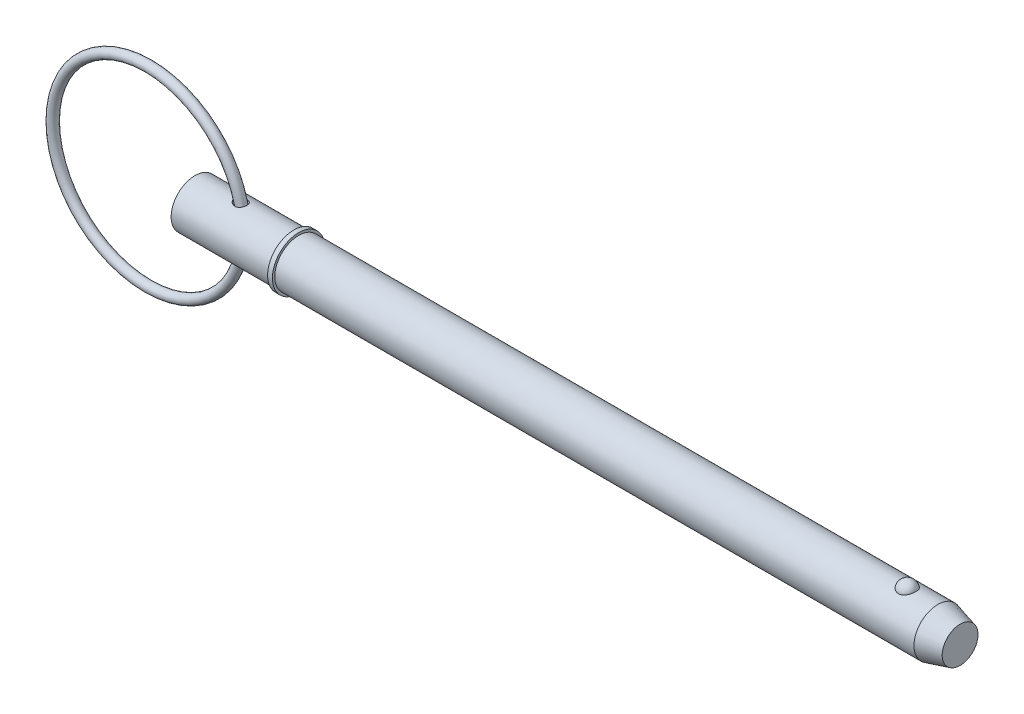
ISO-10303-21;
HEADER;
FILE_DESCRIPTION(('STEP AP214'),'2;1');
FILE_NAME('part.step','',(''),(''),'','','');
FILE_SCHEMA(('AUTOMOTIVE_DESIGN { 1 0 10303 214 1 1 1 1 }'));
ENDSEC;
DATA;
#1=APPLICATION_CONTEXT('core data for automotive mechanical design processes');
#2=APPLICATION_PROTOCOL_DEFINITION('international standard','automotive_design',2000,#1);
#3=PRODUCT_CONTEXT('',#1,'mechanical');
#4=PRODUCT('Part','Part','',(#3));
#5=PRODUCT_RELATED_PRODUCT_CATEGORY('part','',(#4));
#6=PRODUCT_DEFINITION_FORMATION('','',#4);
#7=PRODUCT_DEFINITION_CONTEXT('part definition',#1,'design');
#8=PRODUCT_DEFINITION('design','',#6,#7);
#9=PRODUCT_DEFINITION_SHAPE('','',#8);
#10=(LENGTH_UNIT() NAMED_UNIT(*) SI_UNIT(.MILLI.,.METRE.));
#11=(NAMED_UNIT(*) PLANE_ANGLE_UNIT() SI_UNIT($,.RADIAN.));
#12=(NAMED_UNIT(*) SI_UNIT($,.STERADIAN.) SOLID_ANGLE_UNIT());
#13=UNCERTAINTY_MEASURE_WITH_UNIT(LENGTH_MEASURE(1.E-05),#10,'distance_accuracy_value','');
#14=(GEOMETRIC_REPRESENTATION_CONTEXT(3) GLOBAL_UNCERTAINTY_ASSIGNED_CONTEXT((#13)) GLOBAL_UNIT_ASSIGNED_CONTEXT((#10,
#11,#12)) REPRESENTATION_CONTEXT('',''));
#15=CARTESIAN_POINT('',(0.,0.,0.));
#16=DIRECTION('',(0.,0.,1.));
#17=DIRECTION('',(1.,0.,0.));
#18=AXIS2_PLACEMENT_3D('',#15,#16,#17);
#19=CARTESIAN_POINT('',(-10.8860601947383,0.,0.));
#20=DIRECTION('',(0.,0.,1.));
#21=DIRECTION('',(1.,0.,0.));
#22=AXIS2_PLACEMENT_3D('',#19,#20,#21);
#23=TOROIDAL_SURFACE('',#22,22.225,1.111);
#24=CARTESIAN_POINT('',(12.4499398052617,0.,0.));
#25=VERTEX_POINT('',#24);
#26=VERTEX_LOOP('',#25);
#27=FACE_BOUND('',#26,.T.);
#28=ADVANCED_FACE('P0_F12',(#27),#23,.T.);
#29=CLOSED_SHELL('',(#28));
#30=MANIFOLD_SOLID_BREP('P0_B1',#29);
#31=CARTESIAN_POINT('',(0.,0.,0.));
#32=DIRECTION('',(1.,0.,0.));
#33=DIRECTION('',(0.,0.,-1.));
#34=AXIS2_PLACEMENT_3D('',#31,#32,#33);
#35=CYLINDRICAL_SURFACE('',#34,5.555);
#36=CARTESIAN_POINT('',(9.73108588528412,5.4531967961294,-1.05861687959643));
#37=CARTESIAN_POINT('',(9.79852417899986,5.4428857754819,-1.11173367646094));
#38=CARTESIAN_POINT('',(9.8705426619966,5.43287373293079,-1.15917228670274));
#39=CARTESIAN_POINT('',(10.0216706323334,5.41463354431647,-1.24159548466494));
#40=CARTESIAN_POINT('',(10.100788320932,5.40640749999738,-1.27656543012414));
#41=CARTESIAN_POINT('',(10.2640671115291,5.39277501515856,-1.33298568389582));
#42=CARTESIAN_POINT('',(10.3482338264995,5.38737178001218,-1.35442062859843));
#43=CARTESIAN_POINT('',(10.5191189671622,5.38018930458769,-1.38268153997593));
#44=CARTESIAN_POINT('',(10.6058357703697,5.37840780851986,-1.38951660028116));
#45=CARTESIAN_POINT('',(10.7759121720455,5.37883071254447,-1.38787777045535));
#46=CARTESIAN_POINT('',(10.8592768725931,5.38088957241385,-1.37996287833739));
#47=CARTESIAN_POINT('',(11.0231742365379,5.38856355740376,-1.34968531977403));
#48=CARTESIAN_POINT('',(11.1037078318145,5.39417750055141,-1.3273274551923));
#49=CARTESIAN_POINT('',(11.2542656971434,5.40784427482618,-1.27044672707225));
#50=CARTESIAN_POINT('',(11.3246325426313,5.41571997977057,-1.23678468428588));
#51=CARTESIAN_POINT('',(11.4584043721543,5.43310849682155,-1.15800564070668));
#52=CARTESIAN_POINT('',(11.5218100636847,5.44262114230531,-1.11288980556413));
#53=CARTESIAN_POINT('',(11.6387006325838,5.4619946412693,-1.01348173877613));
#54=CARTESIAN_POINT('',(11.6923567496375,5.47184490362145,-0.959388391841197));
#55=CARTESIAN_POINT('',(11.7899079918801,5.49098914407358,-0.842935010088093));
#56=CARTESIAN_POINT('',(11.8338027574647,5.5002831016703,-0.780574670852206));
#57=CARTESIAN_POINT('',(11.9111930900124,5.51740919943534,-0.648605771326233));
#58=CARTESIAN_POINT('',(11.944571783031,5.52522454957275,-0.578926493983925));
#59=CARTESIAN_POINT('',(11.9994972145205,5.5384271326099,-0.434834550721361));
#60=CARTESIAN_POINT('',(12.0210434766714,5.54381426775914,-0.360421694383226));
#61=CARTESIAN_POINT('',(12.0519313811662,5.55161917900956,-0.208311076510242));
#62=CARTESIAN_POINT('',(12.0611710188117,5.55401212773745,-0.130591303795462));
#63=CARTESIAN_POINT('',(12.0668974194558,5.55548938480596,0.025348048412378));
#64=CARTESIAN_POINT('',(12.0633840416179,5.55457365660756,0.103567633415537));
#65=CARTESIAN_POINT('',(12.0436796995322,5.54953010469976,0.258343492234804));
#66=CARTESIAN_POINT('',(12.0274798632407,5.54540003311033,0.334898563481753));
#67=CARTESIAN_POINT('',(11.9827711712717,5.53437033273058,0.484118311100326));
#68=CARTESIAN_POINT('',(11.9542620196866,5.52747063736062,0.556782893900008));
#69=CARTESIAN_POINT('',(11.8856108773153,5.51165296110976,0.696153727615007));
#70=CARTESIAN_POINT('',(11.8454690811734,5.50273501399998,0.762860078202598));
#71=CARTESIAN_POINT('',(11.7545317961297,5.48386724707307,0.888403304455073));
#72=CARTESIAN_POINT('',(11.7037367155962,5.47391746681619,0.94724048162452));
#73=CARTESIAN_POINT('',(11.5931044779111,5.45416351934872,1.05504470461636));
#74=CARTESIAN_POINT('',(11.533318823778,5.44435885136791,1.10406448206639));
#75=CARTESIAN_POINT('',(11.4061321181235,5.42595363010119,1.19123649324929));
#76=CARTESIAN_POINT('',(11.3387321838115,5.41735290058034,1.22939031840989));
#77=CARTESIAN_POINT('',(11.1991395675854,5.4024225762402,1.29341737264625));
#78=CARTESIAN_POINT('',(11.1270175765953,5.3960658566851,1.3194385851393));
#79=CARTESIAN_POINT('',(10.979323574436,5.38614405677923,1.35937634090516));
#80=CARTESIAN_POINT('',(10.9037515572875,5.38257898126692,1.37329286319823));
#81=CARTESIAN_POINT('',(10.7507722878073,5.37854282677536,1.38901730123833));
#82=CARTESIAN_POINT('',(10.6733560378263,5.37809300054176,1.39074204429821));
#83=CARTESIAN_POINT('',(10.5192388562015,5.38029043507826,1.38221411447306));
#84=CARTESIAN_POINT('',(10.4425381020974,5.38293844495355,1.37195854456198));
#85=CARTESIAN_POINT('',(10.2878936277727,5.39116673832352,1.33926960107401));
#86=CARTESIAN_POINT('',(10.2100819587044,5.3968880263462,1.31624874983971));
#87=CARTESIAN_POINT('',(10.0591420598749,5.4106466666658,1.25849276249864));
#88=CARTESIAN_POINT('',(9.98601576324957,5.41868496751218,1.22375282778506));
#89=CARTESIAN_POINT('',(9.84175565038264,5.43675805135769,1.14087469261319));
#90=CARTESIAN_POINT('',(9.77103801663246,5.44688674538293,1.09202994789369));
#91=CARTESIAN_POINT('',(9.63888287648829,5.46759592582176,0.983100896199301));
#92=CARTESIAN_POINT('',(9.57744762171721,5.47817652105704,0.923013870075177));
#93=CARTESIAN_POINT('',(9.4662044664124,5.49850106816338,0.792984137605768));
#94=CARTESIAN_POINT('',(9.4163677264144,5.5082470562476,0.723066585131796));
#95=CARTESIAN_POINT('',(9.33050546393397,5.52566389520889,0.574973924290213));
#96=CARTESIAN_POINT('',(9.29446727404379,5.53333664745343,0.496806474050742));
#97=CARTESIAN_POINT('',(9.24109888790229,5.54491199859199,0.342579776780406));
#98=CARTESIAN_POINT('',(9.22228936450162,5.54910883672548,0.26705568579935));
#99=CARTESIAN_POINT('',(9.19883437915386,5.55436306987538,0.113748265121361));
#100=CARTESIAN_POINT('',(9.19417820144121,5.55542284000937,0.0359666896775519));
#101=CARTESIAN_POINT('',(9.19905385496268,5.55432298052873,-0.111477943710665));
#102=CARTESIAN_POINT('',(9.20724428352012,5.55246769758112,-0.181191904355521));
#103=CARTESIAN_POINT('',(9.23493000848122,5.54630180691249,-0.318223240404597));
#104=CARTESIAN_POINT('',(9.25442702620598,5.54199082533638,-0.385540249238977));
#105=CARTESIAN_POINT('',(9.30387481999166,5.5313474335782,-0.516280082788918));
#106=CARTESIAN_POINT('',(9.33386163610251,5.52500806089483,-0.579688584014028));
#107=CARTESIAN_POINT('',(9.40305503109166,5.51092599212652,-0.701037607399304));
#108=CARTESIAN_POINT('',(9.44225922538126,5.50318365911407,-0.758979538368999));
#109=CARTESIAN_POINT('',(9.52133732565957,5.48833949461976,-0.859230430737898));
#110=CARTESIAN_POINT('',(9.55998996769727,5.48134889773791,-0.902529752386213));
#111=CARTESIAN_POINT('',(9.64209346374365,5.46725903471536,-0.984288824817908));
#112=CARTESIAN_POINT('',(9.68554534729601,5.46015974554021,-1.02274753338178));
#113=CARTESIAN_POINT('',(9.73108588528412,5.4531967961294,-1.05861687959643));
#114=B_SPLINE_CURVE_WITH_KNOTS('',3,(#36,#37,#38,#39,#40,#41,#42,#43,#44,#45,#46,#47,#48,#49,
#50,#51,#52,#53,#54,#55,#56,#57,#58,#59,#60,#61,#62,#63,#64,#65,#66,#67,#68,#69,#70,#71,#72,#73,
#74,#75,#76,#77,#78,#79,#80,#81,#82,#83,#84,#85,#86,#87,#88,#89,#90,#91,#92,#93,#94,#95,#96,#97,
#98,#99,#100,#101,#102,#103,#104,#105,#106,#107,#108,#109,#110,#111,#112,#113),.UNSPECIFIED.,
.T.,.F.,(4,2,2,2,2,2,2,2,2,2,2,2,2,2,2,2,2,2,2,2,2,2,2,2,2,2,2,2,2,2,2,2,2,2,2,2,2,2,4),(0.,
0.259176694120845,0.518656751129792,0.778430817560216,1.03804303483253,1.28801585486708,
1.53790560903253,1.77195750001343,2.00598558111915,2.23539047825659,2.4648038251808,
2.69668356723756,2.9285726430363,3.16237203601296,3.39617401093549,3.63013963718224,
3.86411088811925,4.09807822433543,4.33203659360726,4.56470246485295,4.79733424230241,
5.02704913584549,5.25676442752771,5.48804534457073,5.71938220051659,5.96237360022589,
6.20546461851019,6.46387943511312,6.72235683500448,6.98018450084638,7.23777490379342,
7.4702968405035,7.70264268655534,7.91229396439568,8.12197716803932,8.33238797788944,
8.54274441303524,8.71772674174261,8.89274668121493),.UNSPECIFIED.);
#115=CARTESIAN_POINT('',(9.73108588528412,5.4531967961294,-1.05861687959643));
#116=VERTEX_POINT('',#115);
#117=EDGE_CURVE('P1_E42',#116,#116,#114,.T.);
#118=ORIENTED_EDGE('',*,*,#117,.T.);
#119=EDGE_LOOP('',(#118));
#120=FACE_BOUND('',#119,.T.);
#121=CARTESIAN_POINT('',(0.,0.,0.));
#122=DIRECTION('',(1.,0.,0.));
#123=DIRECTION('',(0.,0.,-1.));
#124=AXIS2_PLACEMENT_3D('',#121,#122,#123);
#125=CIRCLE('',#124,5.555);
#126=CARTESIAN_POINT('',(0.,0.,-5.555));
#127=VERTEX_POINT('',#126);
#128=EDGE_CURVE('P1_E9',#127,#127,#125,.T.);
#129=ORIENTED_EDGE('',*,*,#128,.T.);
#130=EDGE_LOOP('',(#129));
#131=FACE_BOUND('',#130,.T.);
#132=CARTESIAN_POINT('',(23.019,0.,0.));
#133=DIRECTION('',(1.,0.,0.));
#134=DIRECTION('',(0.,0.,-1.));
#135=AXIS2_PLACEMENT_3D('',#132,#133,#134);
#136=CIRCLE('',#135,5.555);
#137=CARTESIAN_POINT('',(23.019,0.,-5.555));
#138=VERTEX_POINT('',#137);
#139=EDGE_CURVE('P1_E25',#138,#138,#136,.T.);
#140=ORIENTED_EDGE('',*,*,#139,.F.);
#141=EDGE_LOOP('',(#140));
#142=FACE_BOUND('',#141,.T.);
#143=CARTESIAN_POINT('',(9.73108588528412,-5.4531967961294,-1.05861687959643));
#144=CARTESIAN_POINT('',(9.66821110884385,-5.46281068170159,-1.00909184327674));
#145=CARTESIAN_POINT('',(9.60927221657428,-5.47269103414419,-0.954597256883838));
#146=CARTESIAN_POINT('',(9.50103698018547,-5.49196271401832,-0.836622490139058));
#147=CARTESIAN_POINT('',(9.45174193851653,-5.50135397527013,-0.773141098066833));
#148=CARTESIAN_POINT('',(9.36449982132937,-5.51864538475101,-0.638139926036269));
#149=CARTESIAN_POINT('',(9.32660692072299,-5.52653835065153,-0.566583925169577));
#150=CARTESIAN_POINT('',(9.26443740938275,-5.53978685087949,-0.417563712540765));
#151=CARTESIAN_POINT('',(9.24015003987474,-5.54514438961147,-0.34010422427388));
#152=CARTESIAN_POINT('',(9.20806696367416,-5.55228040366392,-0.188389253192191));
#153=CARTESIAN_POINT('',(9.19907227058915,-5.55431849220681,-0.114399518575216));
#154=CARTESIAN_POINT('',(9.19432225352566,-5.55539069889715,0.0340148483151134));
#155=CARTESIAN_POINT('',(9.19856204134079,-5.55442592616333,0.108439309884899));
#156=CARTESIAN_POINT('',(9.21926816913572,-5.54978420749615,0.250226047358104));
#157=CARTESIAN_POINT('',(9.2348766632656,-5.54629766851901,0.31772275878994));
#158=CARTESIAN_POINT('',(9.27656619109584,-5.53719805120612,0.449233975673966));
#159=CARTESIAN_POINT('',(9.3026486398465,-5.53158468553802,0.513248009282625));
#160=CARTESIAN_POINT('',(9.36540111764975,-5.51852259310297,0.63880901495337));
#161=CARTESIAN_POINT('',(9.40244578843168,-5.51101059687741,0.700161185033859));
#162=CARTESIAN_POINT('',(9.48531033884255,-5.49498546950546,0.816463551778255));
#163=CARTESIAN_POINT('',(9.5311337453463,-5.48647193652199,0.871411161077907));
#164=CARTESIAN_POINT('',(9.63549825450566,-5.46826315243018,0.979510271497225));
#165=CARTESIAN_POINT('',(9.69487291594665,-5.4585383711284,1.03185240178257));
#166=CARTESIAN_POINT('',(9.82107706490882,-5.43973797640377,1.12677509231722));
#167=CARTESIAN_POINT('',(9.8879103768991,-5.43066269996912,1.16935061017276));
#168=CARTESIAN_POINT('',(10.033391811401,-5.41336505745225,1.24708757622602));
#169=CARTESIAN_POINT('',(10.1125613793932,-5.40528106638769,1.28130933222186));
#170=CARTESIAN_POINT('',(10.2757060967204,-5.39196874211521,1.3362270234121));
#171=CARTESIAN_POINT('',(10.3596813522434,-5.38674047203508,1.35692265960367));
#172=CARTESIAN_POINT('',(10.5297702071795,-5.37991196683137,1.38375156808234));
#173=CARTESIAN_POINT('',(10.6158742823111,-5.37829778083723,1.38994084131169));
#174=CARTESIAN_POINT('',(10.7878226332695,-5.37901070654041,1.38718250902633));
#175=CARTESIAN_POINT('',(10.8736670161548,-5.38133587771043,1.37824235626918));
#176=CARTESIAN_POINT('',(11.0366214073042,-5.38945418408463,1.34612618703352));
#177=CARTESIAN_POINT('',(11.1139351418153,-5.39501006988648,1.32392147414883));
#178=CARTESIAN_POINT('',(11.2633246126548,-5.40877222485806,1.26652021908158));
#179=CARTESIAN_POINT('',(11.3354015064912,-5.41697790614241,1.23132655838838));
#180=CARTESIAN_POINT('',(11.4690899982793,-5.43466078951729,1.15069817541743));
#181=CARTESIAN_POINT('',(11.5310200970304,-5.4440673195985,1.10577441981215));
#182=CARTESIAN_POINT('',(11.6463540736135,-5.46335537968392,1.0061512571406));
#183=CARTESIAN_POINT('',(11.6997580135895,-5.47323690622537,0.951451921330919));
#184=CARTESIAN_POINT('',(11.7967319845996,-5.49239864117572,0.833747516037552));
#185=CARTESIAN_POINT('',(11.8402908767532,-5.50167816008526,0.770733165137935));
#186=CARTESIAN_POINT('',(11.9164538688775,-5.518621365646,0.638202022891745));
#187=CARTESIAN_POINT('',(11.9490573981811,-5.52628496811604,0.568684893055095));
#188=CARTESIAN_POINT('',(12.0028717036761,-5.53925911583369,0.424207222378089));
#189=CARTESIAN_POINT('',(12.023941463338,-5.54454040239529,0.349191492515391));
#190=CARTESIAN_POINT('',(12.053591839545,-5.55204602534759,0.196582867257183));
#191=CARTESIAN_POINT('',(12.0621722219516,-5.55427030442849,0.118989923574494));
#192=CARTESIAN_POINT('',(12.0666512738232,-5.55542602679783,-0.0368468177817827));
#193=CARTESIAN_POINT('',(12.0625074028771,-5.55434642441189,-0.11509192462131));
#194=CARTESIAN_POINT('',(12.0415418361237,-5.54898613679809,-0.269753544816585));
#195=CARTESIAN_POINT('',(12.0247199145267,-5.54470539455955,-0.346170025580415));
#196=CARTESIAN_POINT('',(11.9787920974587,-5.53340452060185,-0.495008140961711));
#197=CARTESIAN_POINT('',(11.9496857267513,-5.52638428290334,-0.56742962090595));
#198=CARTESIAN_POINT('',(11.8798787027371,-5.51036911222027,-0.706216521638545));
#199=CARTESIAN_POINT('',(11.8391779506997,-5.50137416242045,-0.772581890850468));
#200=CARTESIAN_POINT('',(11.7472553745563,-5.48242167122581,-0.897247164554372));
#201=CARTESIAN_POINT('',(11.6960515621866,-5.47246579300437,-0.955560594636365));
#202=CARTESIAN_POINT('',(11.5843994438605,-5.45270071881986,-1.06256643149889));
#203=CARTESIAN_POINT('',(11.5239521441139,-5.44289150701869,-1.11125988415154));
#204=CARTESIAN_POINT('',(11.396157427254,-5.42463941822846,-1.19717500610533));
#205=CARTESIAN_POINT('',(11.3288903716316,-5.41618309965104,-1.23451335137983));
#206=CARTESIAN_POINT('',(11.1888557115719,-5.40145691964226,-1.29743539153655));
#207=CARTESIAN_POINT('',(11.1160887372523,-5.39518680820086,-1.32302043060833));
#208=CARTESIAN_POINT('',(10.9677009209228,-5.38553131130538,-1.36179181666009));
#209=CARTESIAN_POINT('',(10.8921036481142,-5.38212602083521,-1.3750637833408));
#210=CARTESIAN_POINT('',(10.7396925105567,-5.37842027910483,-1.38948741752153));
#211=CARTESIAN_POINT('',(10.6628784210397,-5.37812040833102,-1.39063681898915));
#212=CARTESIAN_POINT('',(10.5077947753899,-5.38059635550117,-1.38102577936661));
#213=CARTESIAN_POINT('',(10.4295489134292,-5.3834629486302,-1.36991384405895));
#214=CARTESIAN_POINT('',(10.2758428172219,-5.3920092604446,-1.33587599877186));
#215=CARTESIAN_POINT('',(10.2003829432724,-5.39768934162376,-1.31294856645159));
#216=CARTESIAN_POINT('',(10.0559381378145,-5.4110281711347,-1.25682313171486));
#217=CARTESIAN_POINT('',(9.98683368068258,-5.41862962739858,-1.22391777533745));
#218=CARTESIAN_POINT('',(9.85432617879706,-5.43513913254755,-1.14838146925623));
#219=CARTESIAN_POINT('',(9.79092361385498,-5.44404729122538,-1.1057497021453));
#220=CARTESIAN_POINT('',(9.73108588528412,-5.4531967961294,-1.05861687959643));
#221=B_SPLINE_CURVE_WITH_KNOTS('',3,(#143,#144,#145,#146,#147,#148,#149,#150,#151,#152,#153,
#154,#155,#156,#157,#158,#159,#160,#161,#162,#163,#164,#165,#166,#167,#168,#169,#170,#171,#172,
#173,#174,#175,#176,#177,#178,#179,#180,#181,#182,#183,#184,#185,#186,#187,#188,#189,#190,#191,
#192,#193,#194,#195,#196,#197,#198,#199,#200,#201,#202,#203,#204,#205,#206,#207,#208,#209,#210,
#211,#212,#213,#214,#215,#216,#217,#218,#219,#220),.UNSPECIFIED.,.T.,.F.,(4,2,2,2,2,2,2,2,2,2,2,
2,2,2,2,2,2,2,2,2,2,2,2,2,2,2,2,2,2,2,2,2,2,2,2,2,2,2,4),(0.,0.241596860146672,
0.483226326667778,0.725986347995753,0.968554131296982,1.19103755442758,1.41343881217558,
1.62059806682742,1.82778531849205,2.04308674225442,2.25847484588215,2.4967195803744,
2.73508704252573,2.99374644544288,3.25241156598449,3.51007646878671,3.76761448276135,
4.00827541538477,4.24888299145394,4.47904430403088,4.70920393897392,4.93962269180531,
5.17005344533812,5.4032419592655,5.63643484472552,5.87040820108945,6.10438572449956,
6.33837230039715,6.57236086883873,6.80595147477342,7.03951667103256,7.27059385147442,
7.50164459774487,7.73107640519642,7.96055109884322,8.19677907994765,8.43303750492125,
8.66294515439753,8.89287213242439),.UNSPECIFIED.);
#222=CARTESIAN_POINT('',(9.73108588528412,-5.4531967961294,-1.05861687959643));
#223=VERTEX_POINT('',#222);
#224=EDGE_CURVE('P1_E17',#223,#223,#221,.T.);
#225=ORIENTED_EDGE('',*,*,#224,.T.);
#226=EDGE_LOOP('',(#225));
#227=FACE_BOUND('',#226,.T.);
#228=ADVANCED_FACE('P1_F13',(#120,#131,#142,#227),#35,.T.);
#229=CARTESIAN_POINT('',(0.,0.,0.));
#230=DIRECTION('',(1.,0.,0.));
#231=DIRECTION('',(0.,0.,-1.));
#232=AXIS2_PLACEMENT_3D('',#229,#230,#231);
#233=CYLINDRICAL_SURFACE('',#232,5.555);
#234=CARTESIAN_POINT('',(172.917114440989,0.,0.));
#235=DIRECTION('',(1.,0.,0.));
#236=DIRECTION('',(0.,0.,-1.));
#237=AXIS2_PLACEMENT_3D('',#234,#235,#236);
#238=CIRCLE('',#237,5.555);
#239=CARTESIAN_POINT('',(172.917114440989,0.,-5.555));
#240=VERTEX_POINT('',#239);
#241=EDGE_CURVE('P1_E99',#240,#240,#238,.T.);
#242=ORIENTED_EDGE('',*,*,#241,.F.);
#243=EDGE_LOOP('',(#242));
#244=FACE_BOUND('',#243,.T.);
#245=CARTESIAN_POINT('',(24.13,0.,0.));
#246=DIRECTION('',(1.,0.,0.));
#247=DIRECTION('',(0.,0.,-1.));
#248=AXIS2_PLACEMENT_3D('',#245,#246,#247);
#249=CIRCLE('',#248,5.555);
#250=CARTESIAN_POINT('',(24.13,0.,-5.555));
#251=VERTEX_POINT('',#250);
#252=EDGE_CURVE('P1_E96',#251,#251,#249,.T.);
#253=ORIENTED_EDGE('',*,*,#252,.T.);
#254=EDGE_LOOP('',(#253));
#255=FACE_BOUND('',#254,.T.);
#256=CARTESIAN_POINT('',(165.798626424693,5.16741224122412,2.03859650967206));
#257=CARTESIAN_POINT('',(165.692949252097,5.16740893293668,2.03859990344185));
#258=CARTESIAN_POINT('',(165.58729894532,5.17079470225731,2.03008306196));
#259=CARTESIAN_POINT('',(165.379141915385,5.18392795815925,1.99630721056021));
#260=CARTESIAN_POINT('',(165.276634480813,5.19367399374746,1.97105201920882));
#261=CARTESIAN_POINT('',(165.077771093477,5.21839168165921,1.90463997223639));
#262=CARTESIAN_POINT('',(164.981406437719,5.23335573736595,1.8635062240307));
#263=CARTESIAN_POINT('',(164.797080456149,5.26688076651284,1.76652592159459));
#264=CARTESIAN_POINT('',(164.709120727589,5.28544242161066,1.71067657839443));
#265=CARTESIAN_POINT('',(164.541265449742,5.32479845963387,1.58399959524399));
#266=CARTESIAN_POINT('',(164.46166564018,5.34564089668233,1.51279545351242));
#267=CARTESIAN_POINT('',(164.31512901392,5.38697258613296,1.35828584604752));
#268=CARTESIAN_POINT('',(164.248194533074,5.40746177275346,1.27497815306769));
#269=CARTESIAN_POINT('',(164.12561039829,5.44694508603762,1.0944029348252));
#270=CARTESIAN_POINT('',(164.070598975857,5.46583143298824,0.996677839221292));
#271=CARTESIAN_POINT('',(163.976937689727,5.49908030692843,0.792961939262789));
#272=CARTESIAN_POINT('',(163.938289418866,5.513442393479,0.686970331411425));
#273=CARTESIAN_POINT('',(163.877680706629,5.53635851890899,0.468019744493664));
#274=CARTESIAN_POINT('',(163.855972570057,5.54482455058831,0.354981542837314));
#275=CARTESIAN_POINT('',(163.830636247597,5.55473324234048,0.126595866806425));
#276=CARTESIAN_POINT('',(163.827007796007,5.55617600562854,0.01124842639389));
#277=CARTESIAN_POINT('',(163.837881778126,5.55189984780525,-0.218011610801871));
#278=CARTESIAN_POINT('',(163.852315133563,5.54620821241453,-0.331928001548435));
#279=CARTESIAN_POINT('',(163.898903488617,5.52828920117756,-0.555544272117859));
#280=CARTESIAN_POINT('',(163.931058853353,5.5160616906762,-0.665244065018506));
#281=CARTESIAN_POINT('',(164.012488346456,5.48630779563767,-0.877469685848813));
#282=CARTESIAN_POINT('',(164.061781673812,5.4687754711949,-0.979987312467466));
#283=CARTESIAN_POINT('',(164.176478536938,5.43024700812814,-1.17486975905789));
#284=CARTESIAN_POINT('',(164.241883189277,5.4092506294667,-1.26723387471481));
#285=CARTESIAN_POINT('',(164.387571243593,5.36600927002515,-1.4394013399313));
#286=CARTESIAN_POINT('',(164.467885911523,5.34376173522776,-1.51917763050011));
#287=CARTESIAN_POINT('',(164.641452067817,5.30057971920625,-1.66360338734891));
#288=CARTESIAN_POINT('',(164.734702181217,5.27964509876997,-1.72825445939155));
#289=CARTESIAN_POINT('',(164.929393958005,5.24205250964,-1.83909478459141));
#290=CARTESIAN_POINT('',(165.030590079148,5.22530519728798,-1.88568407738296));
#291=CARTESIAN_POINT('',(165.240155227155,5.19750919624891,-1.96100802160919));
#292=CARTESIAN_POINT('',(165.348521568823,5.1864583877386,-1.98974931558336));
#293=CARTESIAN_POINT('',(165.563498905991,5.17184410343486,-2.02742262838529));
#294=CARTESIAN_POINT('',(165.669925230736,5.1679328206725,-2.03727608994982));
#295=CARTESIAN_POINT('',(165.882992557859,5.16698995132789,-2.03966777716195));
#296=CARTESIAN_POINT('',(165.989633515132,5.16995704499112,-2.03220932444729));
#297=CARTESIAN_POINT('',(166.196773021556,5.18222383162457,-2.00071170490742));
#298=CARTESIAN_POINT('',(166.297359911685,5.19133213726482,-1.97717337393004));
#299=CARTESIAN_POINT('',(166.493014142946,5.21467637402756,-1.91475248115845));
#300=CARTESIAN_POINT('',(166.588081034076,5.22891272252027,-1.87586867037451));
#301=CARTESIAN_POINT('',(166.772371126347,5.26137066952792,-1.78282713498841));
#302=CARTESIAN_POINT('',(166.861419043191,5.27967329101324,-1.72835124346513));
#303=CARTESIAN_POINT('',(167.029288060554,5.3181741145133,-1.60597483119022));
#304=CARTESIAN_POINT('',(167.108106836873,5.33837274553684,-1.5380712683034));
#305=CARTESIAN_POINT('',(167.257515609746,5.37968287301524,-1.38688970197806));
#306=CARTESIAN_POINT('',(167.327505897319,5.40079011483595,-1.3030174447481));
#307=CARTESIAN_POINT('',(167.453012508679,5.44074401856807,-1.12458170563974));
#308=CARTESIAN_POINT('',(167.508526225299,5.45959027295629,-1.03001630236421));
#309=CARTESIAN_POINT('',(167.605550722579,5.49369849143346,-0.829439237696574));
#310=CARTESIAN_POINT('',(167.646548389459,5.50882422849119,-0.723155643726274));
#311=CARTESIAN_POINT('',(167.711125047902,5.53310911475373,-0.504772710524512));
#312=CARTESIAN_POINT('',(167.734703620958,5.54226812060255,-0.392673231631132));
#313=CARTESIAN_POINT('',(167.764013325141,5.55370358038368,-0.165459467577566));
#314=CARTESIAN_POINT('',(167.769688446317,5.55595843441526,-0.0503368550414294));
#315=CARTESIAN_POINT('',(167.762916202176,5.55329317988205,0.179288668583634));
#316=CARTESIAN_POINT('',(167.750469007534,5.54837313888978,0.293791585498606));
#317=CARTESIAN_POINT('',(167.707779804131,5.53189037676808,0.518526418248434));
#318=CARTESIAN_POINT('',(167.677598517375,5.5203503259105,0.628771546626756));
#319=CARTESIAN_POINT('',(167.600096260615,5.49182453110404,0.842318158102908));
#320=CARTESIAN_POINT('',(167.552774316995,5.47483847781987,0.945619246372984));
#321=CARTESIAN_POINT('',(167.441720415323,5.43710633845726,1.14281571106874));
#322=CARTESIAN_POINT('',(167.377921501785,5.41634501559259,1.23667048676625));
#323=CARTESIAN_POINT('',(167.235357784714,5.37334572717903,1.4118524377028));
#324=CARTESIAN_POINT('',(167.15659323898,5.35110778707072,1.49317982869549));
#325=CARTESIAN_POINT('',(166.986423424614,5.30779474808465,1.64049162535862));
#326=CARTESIAN_POINT('',(166.89510026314,5.2867132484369,1.70656877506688));
#327=CARTESIAN_POINT('',(166.701739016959,5.2480485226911,1.82201372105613));
#328=CARTESIAN_POINT('',(166.599700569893,5.23046541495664,1.87138095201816));
#329=CARTESIAN_POINT('',(166.383618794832,5.20042692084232,1.95335298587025));
#330=CARTESIAN_POINT('',(166.269260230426,5.18820192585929,1.98521734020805));
#331=CARTESIAN_POINT('',(166.036130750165,5.17169804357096,2.02783294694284));
#332=CARTESIAN_POINT('',(165.917361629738,5.16741595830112,2.03859269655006));
#333=CARTESIAN_POINT('',(165.798626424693,5.16741224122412,2.03859650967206));
#334=B_SPLINE_CURVE_WITH_KNOTS('',3,(#256,#257,#258,#259,#260,#261,#262,#263,#264,#265,#266,
#267,#268,#269,#270,#271,#272,#273,#274,#275,#276,#277,#278,#279,#280,#281,#282,#283,#284,#285,
#286,#287,#288,#289,#290,#291,#292,#293,#294,#295,#296,#297,#298,#299,#300,#301,#302,#303,#304,
#305,#306,#307,#308,#309,#310,#311,#312,#313,#314,#315,#316,#317,#318,#319,#320,#321,#322,#323,
#324,#325,#326,#327,#328,#329,#330,#331,#332,#333),.UNSPECIFIED.,.T.,.F.,(4,2,2,2,2,2,2,2,2,2,2,
2,2,2,2,2,2,2,2,2,2,2,2,2,2,2,2,2,2,2,2,2,2,2,2,2,2,2,4),(0.,0.316595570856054,
0.633118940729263,0.949183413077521,1.26530783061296,1.59030762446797,1.91536729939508,
2.25495824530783,2.59458224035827,2.93917283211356,3.28375835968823,3.62703002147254,
3.97030875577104,4.31397329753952,4.65766166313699,5.00207904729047,5.34645984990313,
5.68270547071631,6.01882587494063,6.33808403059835,6.65728093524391,6.9669637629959,
7.27667180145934,7.59321535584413,7.90983070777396,8.24210387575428,8.57443684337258,
8.91755896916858,9.26068933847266,9.604892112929,9.94909164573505,10.2921194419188,
10.6351667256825,10.9796305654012,11.3240884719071,11.6663928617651,12.0087088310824,
12.3645679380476,12.7202837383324),.UNSPECIFIED.);
#335=CARTESIAN_POINT('',(165.798626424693,5.16741224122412,2.03859650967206));
#336=VERTEX_POINT('',#335);
#337=EDGE_CURVE('P1_E34',#336,#336,#334,.T.);
#338=ORIENTED_EDGE('',*,*,#337,.T.);
#339=EDGE_LOOP('',(#338));
#340=FACE_BOUND('',#339,.T.);
#341=ADVANCED_FACE('P1_F46',(#244,#255,#340),#233,.T.);
#342=CARTESIAN_POINT('',(0.,0.,0.));
#343=DIRECTION('',(-1.,0.,0.));
#344=DIRECTION('',(0.,0.,1.));
#345=AXIS2_PLACEMENT_3D('',#342,#343,#344);
#346=PLANE('',#345);
#347=ORIENTED_EDGE('',*,*,#128,.F.);
#348=EDGE_LOOP('',(#347));
#349=FACE_BOUND('',#348,.T.);
#350=ADVANCED_FACE('P1_F15',(#349),#346,.T.);
#351=CARTESIAN_POINT('',(23.019,5.555,0.));
#352=DIRECTION('',(-1.,0.,0.));
#353=DIRECTION('',(0.,0.,1.));
#354=AXIS2_PLACEMENT_3D('',#351,#352,#353);
#355=PLANE('',#354);
#356=ORIENTED_EDGE('',*,*,#139,.T.);
#357=EDGE_LOOP('',(#356));
#358=FACE_BOUND('',#357,.T.);
#359=CARTESIAN_POINT('',(23.019,0.,0.));
#360=DIRECTION('',(1.,0.,0.));
#361=DIRECTION('',(0.,0.,-1.));
#362=AXIS2_PLACEMENT_3D('',#359,#360,#361);
#363=CIRCLE('',#362,6.1105);
#364=CARTESIAN_POINT('',(23.019,0.,-6.1105));
#365=VERTEX_POINT('',#364);
#366=EDGE_CURVE('P1_E30',#365,#365,#363,.T.);
#367=ORIENTED_EDGE('',*,*,#366,.F.);
#368=EDGE_LOOP('',(#367));
#369=FACE_BOUND('',#368,.T.);
#370=ADVANCED_FACE('P1_F81',(#358,#369),#355,.T.);
#371=CARTESIAN_POINT('',(0.,0.,0.));
#372=DIRECTION('',(1.,0.,0.));
#373=DIRECTION('',(0.,0.,-1.));
#374=AXIS2_PLACEMENT_3D('',#371,#372,#373);
#375=CYLINDRICAL_SURFACE('',#374,6.1105);
#376=ORIENTED_EDGE('',*,*,#366,.T.);
#377=EDGE_LOOP('',(#376));
#378=FACE_BOUND('',#377,.T.);
#379=CARTESIAN_POINT('',(24.13,0.,0.));
#380=DIRECTION('',(1.,0.,0.));
#381=DIRECTION('',(0.,0.,-1.));
#382=AXIS2_PLACEMENT_3D('',#379,#380,#381);
#383=CIRCLE('',#382,6.1105);
#384=CARTESIAN_POINT('',(24.13,0.,-6.1105));
#385=VERTEX_POINT('',#384);
#386=EDGE_CURVE('P1_E95',#385,#385,#383,.T.);
#387=ORIENTED_EDGE('',*,*,#386,.F.);
#388=EDGE_LOOP('',(#387));
#389=FACE_BOUND('',#388,.T.);
#390=ADVANCED_FACE('P1_F68',(#378,#389),#375,.T.);
#391=CARTESIAN_POINT('',(24.13,6.1105,0.));
#392=DIRECTION('',(1.,0.,0.));
#393=DIRECTION('',(0.,0.,-1.));
#394=AXIS2_PLACEMENT_3D('',#391,#392,#393);
#395=PLANE('',#394);
#396=ORIENTED_EDGE('',*,*,#386,.T.);
#397=EDGE_LOOP('',(#396));
#398=FACE_BOUND('',#397,.T.);
#399=ORIENTED_EDGE('',*,*,#252,.F.);
#400=EDGE_LOOP('',(#399));
#401=FACE_BOUND('',#400,.T.);
#402=ADVANCED_FACE('P1_F62',(#398,#401),#395,.T.);
#403=CARTESIAN_POINT('',(178.1,0.,0.));
#404=DIRECTION('',(-1.,0.,0.));
#405=DIRECTION('',(0.,0.,1.));
#406=AXIS2_PLACEMENT_3D('',#403,#404,#405);
#407=CONICAL_SURFACE('',#406,4.16625000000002,0.26179938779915);
#408=ORIENTED_EDGE('',*,*,#241,.T.);
#409=EDGE_LOOP('',(#408));
#410=FACE_BOUND('',#409,.T.);
#411=CARTESIAN_POINT('',(178.1,0.,0.));
#412=DIRECTION('',(1.,0.,0.));
#413=DIRECTION('',(0.,0.,-1.));
#414=AXIS2_PLACEMENT_3D('',#411,#412,#413);
#415=CIRCLE('',#414,4.16625000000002);
#416=CARTESIAN_POINT('',(178.1,0.,-4.16625000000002));
#417=VERTEX_POINT('',#416);
#418=EDGE_CURVE('P1_E41',#417,#417,#415,.T.);
#419=ORIENTED_EDGE('',*,*,#418,.F.);
#420=EDGE_LOOP('',(#419));
#421=FACE_BOUND('',#420,.T.);
#422=ADVANCED_FACE('P1_F59',(#410,#421),#407,.T.);
#423=CARTESIAN_POINT('',(178.1,4.16625000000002,0.));
#424=DIRECTION('',(1.,0.,0.));
#425=DIRECTION('',(0.,0.,-1.));
#426=AXIS2_PLACEMENT_3D('',#423,#424,#425);
#427=PLANE('',#426);
#428=ORIENTED_EDGE('',*,*,#418,.T.);
#429=EDGE_LOOP('',(#428));
#430=FACE_BOUND('',#429,.T.);
#431=ADVANCED_FACE('P1_F55',(#430),#427,.T.);
#432=CARTESIAN_POINT('',(165.798626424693,4.99949999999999,0.));
#433=DIRECTION('',(-1.,0.,0.));
#434=DIRECTION('',(0.,1.,0.));
#435=AXIS2_PLACEMENT_3D('',#432,#433,#434);
#436=SPHERICAL_SURFACE('',#435,2.04550000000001);
#437=ORIENTED_EDGE('',*,*,#337,.F.);
#438=EDGE_LOOP('',(#437));
#439=FACE_BOUND('',#438,.T.);
#440=ADVANCED_FACE('P1_F50',(#439),#436,.T.);
#441=CARTESIAN_POINT('',(-10.8860601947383,0.,0.));
#442=DIRECTION('',(0.,0.,1.));
#443=DIRECTION('',(1.,0.,0.));
#444=AXIS2_PLACEMENT_3D('',#441,#442,#443);
#445=TOROIDAL_SURFACE('',#444,22.225,1.38875);
#446=ORIENTED_EDGE('',*,*,#224,.F.);
#447=EDGE_LOOP('',(#446));
#448=FACE_BOUND('',#447,.T.);
#449=ORIENTED_EDGE('',*,*,#117,.F.);
#450=EDGE_LOOP('',(#449));
#451=FACE_BOUND('',#450,.T.);
#452=ADVANCED_FACE('P1_F54',(#448,#451),#445,.F.);
#453=CLOSED_SHELL('',(#228,#341,#350,#370,#390,#402,#422,#431,#440,#452));
#454=MANIFOLD_SOLID_BREP('P1_B1',#453);
#455=ADVANCED_BREP_SHAPE_REPRESENTATION('',(#18,#30,#454),#14);
#456=SHAPE_DEFINITION_REPRESENTATION(#9,#455);
ENDSEC;
END-ISO-10303-21;
